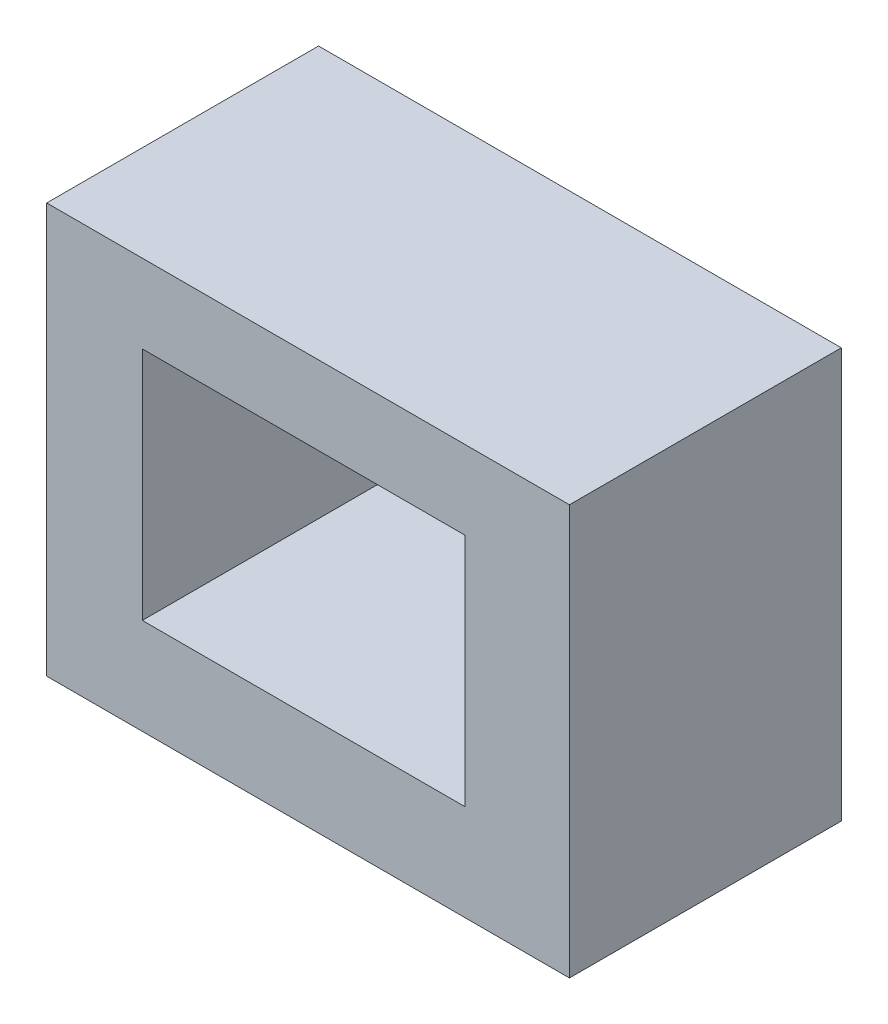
ISO-10303-21;
HEADER;
FILE_DESCRIPTION(('STEP AP214'),'2;1');
FILE_NAME('part.step','',(''),(''),'','','');
FILE_SCHEMA(('AUTOMOTIVE_DESIGN { 1 0 10303 214 1 1 1 1 }'));
ENDSEC;
DATA;
#1=APPLICATION_CONTEXT('core data for automotive mechanical design processes');
#2=APPLICATION_PROTOCOL_DEFINITION('international standard','automotive_design',2000,#1);
#3=PRODUCT_CONTEXT('',#1,'mechanical');
#4=PRODUCT('Part','Part','',(#3));
#5=PRODUCT_RELATED_PRODUCT_CATEGORY('part','',(#4));
#6=PRODUCT_DEFINITION_FORMATION('','',#4);
#7=PRODUCT_DEFINITION_CONTEXT('part definition',#1,'design');
#8=PRODUCT_DEFINITION('design','',#6,#7);
#9=PRODUCT_DEFINITION_SHAPE('','',#8);
#10=(LENGTH_UNIT() NAMED_UNIT(*) SI_UNIT(.MILLI.,.METRE.));
#11=(NAMED_UNIT(*) PLANE_ANGLE_UNIT() SI_UNIT($,.RADIAN.));
#12=(NAMED_UNIT(*) SI_UNIT($,.STERADIAN.) SOLID_ANGLE_UNIT());
#13=UNCERTAINTY_MEASURE_WITH_UNIT(LENGTH_MEASURE(1.E-05),#10,'distance_accuracy_value','');
#14=(GEOMETRIC_REPRESENTATION_CONTEXT(3) GLOBAL_UNCERTAINTY_ASSIGNED_CONTEXT((#13)) GLOBAL_UNIT_ASSIGNED_CONTEXT((#10,
#11,#12)) REPRESENTATION_CONTEXT('',''));
#15=CARTESIAN_POINT('',(0.,0.,0.));
#16=DIRECTION('',(0.,0.,1.));
#17=DIRECTION('',(1.,0.,0.));
#18=AXIS2_PLACEMENT_3D('',#15,#16,#17);
#19=CARTESIAN_POINT('',(-40.3021650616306,32.3007964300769,50.8));
#20=DIRECTION('',(1.,0.,0.));
#21=DIRECTION('',(0.,0.,-1.));
#22=AXIS2_PLACEMENT_3D('',#19,#20,#21);
#23=PLANE('',#22);
#24=DIRECTION('',(0.,-1.,0.));
#25=VECTOR('',#24,1.);
#26=CARTESIAN_POINT('',(-40.3021650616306,32.3007964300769,0.));
#27=LINE('',#26,#25);
#28=CARTESIAN_POINT('',(-40.3021650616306,32.3007964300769,0.));
#29=VERTEX_POINT('',#28);
#30=CARTESIAN_POINT('',(-40.3021650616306,-44.2826803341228,0.));
#31=VERTEX_POINT('',#30);
#32=EDGE_CURVE('E129',#29,#31,#27,.T.);
#33=ORIENTED_EDGE('',*,*,#32,.T.);
#34=DIRECTION('',(0.,0.,-1.));
#35=VECTOR('',#34,1.);
#36=CARTESIAN_POINT('',(-40.3021650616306,-44.2826803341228,50.8));
#37=LINE('',#36,#35);
#38=CARTESIAN_POINT('',(-40.3021650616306,-44.2826803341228,50.8));
#39=VERTEX_POINT('',#38);
#40=EDGE_CURVE('E11',#39,#31,#37,.T.);
#41=ORIENTED_EDGE('',*,*,#40,.F.);
#42=DIRECTION('',(0.,-1.,0.));
#43=VECTOR('',#42,1.);
#44=CARTESIAN_POINT('',(-40.3021650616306,32.3007964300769,50.8));
#45=LINE('',#44,#43);
#46=CARTESIAN_POINT('',(-40.3021650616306,32.3007964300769,50.8));
#47=VERTEX_POINT('',#46);
#48=EDGE_CURVE('E140',#47,#39,#45,.T.);
#49=ORIENTED_EDGE('',*,*,#48,.F.);
#50=DIRECTION('',(0.,0.,-1.));
#51=VECTOR('',#50,1.);
#52=CARTESIAN_POINT('',(-40.3021650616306,32.3007964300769,50.8));
#53=LINE('',#52,#51);
#54=EDGE_CURVE('E149',#47,#29,#53,.T.);
#55=ORIENTED_EDGE('',*,*,#54,.T.);
#56=EDGE_LOOP('',(#33,#41,#49,#55));
#57=FACE_BOUND('',#56,.T.);
#58=ADVANCED_FACE('F31',(#57),#23,.F.);
#59=CARTESIAN_POINT('',(-40.3021650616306,-44.2826803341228,50.8));
#60=DIRECTION('',(0.,1.,0.));
#61=DIRECTION('',(0.,0.,1.));
#62=AXIS2_PLACEMENT_3D('',#59,#60,#61);
#63=PLANE('',#62);
#64=DIRECTION('',(1.,0.,0.));
#65=VECTOR('',#64,1.);
#66=CARTESIAN_POINT('',(-40.3021650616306,-44.2826803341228,0.));
#67=LINE('',#66,#65);
#68=CARTESIAN_POINT('',(57.384314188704,-44.2826803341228,0.));
#69=VERTEX_POINT('',#68);
#70=EDGE_CURVE('E134',#31,#69,#67,.T.);
#71=ORIENTED_EDGE('',*,*,#70,.T.);
#72=DIRECTION('',(0.,0.,-1.));
#73=VECTOR('',#72,1.);
#74=CARTESIAN_POINT('',(57.384314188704,-44.2826803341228,50.8));
#75=LINE('',#74,#73);
#76=CARTESIAN_POINT('',(57.384314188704,-44.2826803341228,50.8));
#77=VERTEX_POINT('',#76);
#78=EDGE_CURVE('E38',#77,#69,#75,.T.);
#79=ORIENTED_EDGE('',*,*,#78,.F.);
#80=DIRECTION('',(1.,0.,0.));
#81=VECTOR('',#80,1.);
#82=CARTESIAN_POINT('',(-40.3021650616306,-44.2826803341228,50.8));
#83=LINE('',#82,#81);
#84=EDGE_CURVE('E143',#39,#77,#83,.T.);
#85=ORIENTED_EDGE('',*,*,#84,.F.);
#86=ORIENTED_EDGE('',*,*,#40,.T.);
#87=EDGE_LOOP('',(#71,#79,#85,#86));
#88=FACE_BOUND('',#87,.T.);
#89=ADVANCED_FACE('F173',(#88),#63,.F.);
#90=CARTESIAN_POINT('',(57.384314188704,32.3007964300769,50.8));
#91=DIRECTION('',(-1.,0.,0.));
#92=DIRECTION('',(0.,0.,1.));
#93=AXIS2_PLACEMENT_3D('',#90,#91,#92);
#94=PLANE('',#93);
#95=DIRECTION('',(0.,1.,0.));
#96=VECTOR('',#95,1.);
#97=CARTESIAN_POINT('',(57.384314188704,32.3007964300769,0.));
#98=LINE('',#97,#96);
#99=CARTESIAN_POINT('',(57.384314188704,32.3007964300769,0.));
#100=VERTEX_POINT('',#99);
#101=EDGE_CURVE('E136',#69,#100,#98,.T.);
#102=ORIENTED_EDGE('',*,*,#101,.T.);
#103=DIRECTION('',(0.,0.,-1.));
#104=VECTOR('',#103,1.);
#105=CARTESIAN_POINT('',(57.384314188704,32.3007964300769,50.8));
#106=LINE('',#105,#104);
#107=CARTESIAN_POINT('',(57.384314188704,32.3007964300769,50.8));
#108=VERTEX_POINT('',#107);
#109=EDGE_CURVE('E152',#108,#100,#106,.T.);
#110=ORIENTED_EDGE('',*,*,#109,.F.);
#111=DIRECTION('',(0.,1.,0.));
#112=VECTOR('',#111,1.);
#113=CARTESIAN_POINT('',(57.384314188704,32.3007964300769,50.8));
#114=LINE('',#113,#112);
#115=EDGE_CURVE('E145',#77,#108,#114,.T.);
#116=ORIENTED_EDGE('',*,*,#115,.F.);
#117=ORIENTED_EDGE('',*,*,#78,.T.);
#118=EDGE_LOOP('',(#102,#110,#116,#117));
#119=FACE_BOUND('',#118,.T.);
#120=ADVANCED_FACE('F159',(#119),#94,.F.);
#121=CARTESIAN_POINT('',(-40.3021650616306,32.3007964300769,50.8));
#122=DIRECTION('',(0.,-1.,0.));
#123=DIRECTION('',(0.,0.,-1.));
#124=AXIS2_PLACEMENT_3D('',#121,#122,#123);
#125=PLANE('',#124);
#126=DIRECTION('',(-1.,0.,0.));
#127=VECTOR('',#126,1.);
#128=CARTESIAN_POINT('',(-40.3021650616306,32.3007964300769,0.));
#129=LINE('',#128,#127);
#130=EDGE_CURVE('E138',#100,#29,#129,.T.);
#131=ORIENTED_EDGE('',*,*,#130,.T.);
#132=ORIENTED_EDGE('',*,*,#54,.F.);
#133=DIRECTION('',(-1.,0.,0.));
#134=VECTOR('',#133,1.);
#135=CARTESIAN_POINT('',(-40.3021650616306,32.3007964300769,50.8));
#136=LINE('',#135,#134);
#137=EDGE_CURVE('E147',#108,#47,#136,.T.);
#138=ORIENTED_EDGE('',*,*,#137,.F.);
#139=ORIENTED_EDGE('',*,*,#109,.T.);
#140=EDGE_LOOP('',(#131,#132,#138,#139));
#141=FACE_BOUND('',#140,.T.);
#142=ADVANCED_FACE('F168',(#141),#125,.F.);
#143=CARTESIAN_POINT('',(-40.3021650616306,-44.2826803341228,50.8));
#144=DIRECTION('',(0.,0.,1.));
#145=DIRECTION('',(1.,0.,0.));
#146=AXIS2_PLACEMENT_3D('',#143,#144,#145);
#147=PLANE('',#146);
#148=DIRECTION('',(0.,-1.,0.));
#149=VECTOR('',#148,1.);
#150=CARTESIAN_POINT('',(-22.4365812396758,17.6175798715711,50.8));
#151=LINE('',#150,#149);
#152=CARTESIAN_POINT('',(-22.4365812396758,17.6175798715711,50.8));
#153=VERTEX_POINT('',#152);
#154=CARTESIAN_POINT('',(-22.4365812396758,-26.3242931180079,50.8));
#155=VERTEX_POINT('',#154);
#156=EDGE_CURVE('E45',#153,#155,#151,.T.);
#157=ORIENTED_EDGE('',*,*,#156,.F.);
#158=DIRECTION('',(-1.,0.,0.));
#159=VECTOR('',#158,1.);
#160=CARTESIAN_POINT('',(-22.4365812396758,17.6175798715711,50.8));
#161=LINE('',#160,#159);
#162=CARTESIAN_POINT('',(37.8811450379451,17.6175798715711,50.8));
#163=VERTEX_POINT('',#162);
#164=EDGE_CURVE('E113',#163,#153,#161,.T.);
#165=ORIENTED_EDGE('',*,*,#164,.F.);
#166=DIRECTION('',(0.,1.,0.));
#167=VECTOR('',#166,1.);
#168=CARTESIAN_POINT('',(37.8811450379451,17.6175798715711,50.8));
#169=LINE('',#168,#167);
#170=CARTESIAN_POINT('',(37.8811450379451,-26.3242931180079,50.8));
#171=VERTEX_POINT('',#170);
#172=EDGE_CURVE('E97',#171,#163,#169,.T.);
#173=ORIENTED_EDGE('',*,*,#172,.F.);
#174=DIRECTION('',(1.,0.,0.));
#175=VECTOR('',#174,1.);
#176=CARTESIAN_POINT('',(-22.4365812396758,-26.3242931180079,50.8));
#177=LINE('',#176,#175);
#178=EDGE_CURVE('E106',#155,#171,#177,.T.);
#179=ORIENTED_EDGE('',*,*,#178,.F.);
#180=EDGE_LOOP('',(#157,#165,#173,#179));
#181=FACE_BOUND('',#180,.T.);
#182=ORIENTED_EDGE('',*,*,#48,.T.);
#183=ORIENTED_EDGE('',*,*,#84,.T.);
#184=ORIENTED_EDGE('',*,*,#115,.T.);
#185=ORIENTED_EDGE('',*,*,#137,.T.);
#186=EDGE_LOOP('',(#182,#183,#184,#185));
#187=FACE_BOUND('',#186,.T.);
#188=ADVANCED_FACE('F110',(#181,#187),#147,.T.);
#189=CARTESIAN_POINT('',(-40.3021650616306,-44.2826803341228,0.));
#190=DIRECTION('',(0.,0.,1.));
#191=DIRECTION('',(1.,0.,0.));
#192=AXIS2_PLACEMENT_3D('',#189,#190,#191);
#193=PLANE('',#192);
#194=DIRECTION('',(-1.,0.,0.));
#195=VECTOR('',#194,1.);
#196=CARTESIAN_POINT('',(-22.4365812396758,17.6175798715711,0.));
#197=LINE('',#196,#195);
#198=CARTESIAN_POINT('',(37.8811450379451,17.6175798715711,0.));
#199=VERTEX_POINT('',#198);
#200=CARTESIAN_POINT('',(-22.4365812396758,17.6175798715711,0.));
#201=VERTEX_POINT('',#200);
#202=EDGE_CURVE('E124',#199,#201,#197,.T.);
#203=ORIENTED_EDGE('',*,*,#202,.T.);
#204=DIRECTION('',(0.,-1.,0.));
#205=VECTOR('',#204,1.);
#206=CARTESIAN_POINT('',(-22.4365812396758,17.6175798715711,0.));
#207=LINE('',#206,#205);
#208=CARTESIAN_POINT('',(-22.4365812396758,-26.3242931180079,0.));
#209=VERTEX_POINT('',#208);
#210=EDGE_CURVE('E115',#201,#209,#207,.T.);
#211=ORIENTED_EDGE('',*,*,#210,.T.);
#212=DIRECTION('',(1.,0.,0.));
#213=VECTOR('',#212,1.);
#214=CARTESIAN_POINT('',(-22.4365812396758,-26.3242931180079,0.));
#215=LINE('',#214,#213);
#216=CARTESIAN_POINT('',(37.8811450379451,-26.3242931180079,0.));
#217=VERTEX_POINT('',#216);
#218=EDGE_CURVE('E121',#209,#217,#215,.T.);
#219=ORIENTED_EDGE('',*,*,#218,.T.);
#220=DIRECTION('',(0.,1.,0.));
#221=VECTOR('',#220,1.);
#222=CARTESIAN_POINT('',(37.8811450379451,17.6175798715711,0.));
#223=LINE('',#222,#221);
#224=EDGE_CURVE('E53',#217,#199,#223,.T.);
#225=ORIENTED_EDGE('',*,*,#224,.T.);
#226=EDGE_LOOP('',(#203,#211,#219,#225));
#227=FACE_BOUND('',#226,.T.);
#228=ORIENTED_EDGE('',*,*,#32,.F.);
#229=ORIENTED_EDGE('',*,*,#130,.F.);
#230=ORIENTED_EDGE('',*,*,#101,.F.);
#231=ORIENTED_EDGE('',*,*,#70,.F.);
#232=EDGE_LOOP('',(#228,#229,#230,#231));
#233=FACE_BOUND('',#232,.T.);
#234=ADVANCED_FACE('F165',(#227,#233),#193,.F.);
#235=CARTESIAN_POINT('',(-22.4365812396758,17.6175798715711,0.));
#236=DIRECTION('',(-1.,0.,0.));
#237=DIRECTION('',(0.,0.,1.));
#238=AXIS2_PLACEMENT_3D('',#235,#236,#237);
#239=PLANE('',#238);
#240=ORIENTED_EDGE('',*,*,#156,.T.);
#241=DIRECTION('',(0.,0.,1.));
#242=VECTOR('',#241,1.);
#243=CARTESIAN_POINT('',(-22.4365812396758,-26.3242931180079,0.));
#244=LINE('',#243,#242);
#245=EDGE_CURVE('E103',#209,#155,#244,.T.);
#246=ORIENTED_EDGE('',*,*,#245,.F.);
#247=ORIENTED_EDGE('',*,*,#210,.F.);
#248=DIRECTION('',(0.,0.,1.));
#249=VECTOR('',#248,1.);
#250=CARTESIAN_POINT('',(-22.4365812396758,17.6175798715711,0.));
#251=LINE('',#250,#249);
#252=EDGE_CURVE('E127',#201,#153,#251,.T.);
#253=ORIENTED_EDGE('',*,*,#252,.T.);
#254=EDGE_LOOP('',(#240,#246,#247,#253));
#255=FACE_BOUND('',#254,.T.);
#256=ADVANCED_FACE('F187',(#255),#239,.F.);
#257=CARTESIAN_POINT('',(-22.4365812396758,17.6175798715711,0.));
#258=DIRECTION('',(0.,1.,0.));
#259=DIRECTION('',(0.,0.,1.));
#260=AXIS2_PLACEMENT_3D('',#257,#258,#259);
#261=PLANE('',#260);
#262=ORIENTED_EDGE('',*,*,#164,.T.);
#263=ORIENTED_EDGE('',*,*,#252,.F.);
#264=ORIENTED_EDGE('',*,*,#202,.F.);
#265=DIRECTION('',(0.,0.,1.));
#266=VECTOR('',#265,1.);
#267=CARTESIAN_POINT('',(37.8811450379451,17.6175798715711,0.));
#268=LINE('',#267,#266);
#269=EDGE_CURVE('E102',#199,#163,#268,.T.);
#270=ORIENTED_EDGE('',*,*,#269,.T.);
#271=EDGE_LOOP('',(#262,#263,#264,#270));
#272=FACE_BOUND('',#271,.T.);
#273=ADVANCED_FACE('F191',(#272),#261,.F.);
#274=CARTESIAN_POINT('',(37.8811450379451,17.6175798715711,0.));
#275=DIRECTION('',(1.,0.,0.));
#276=DIRECTION('',(0.,0.,-1.));
#277=AXIS2_PLACEMENT_3D('',#274,#275,#276);
#278=PLANE('',#277);
#279=ORIENTED_EDGE('',*,*,#172,.T.);
#280=ORIENTED_EDGE('',*,*,#269,.F.);
#281=ORIENTED_EDGE('',*,*,#224,.F.);
#282=DIRECTION('',(0.,0.,1.));
#283=VECTOR('',#282,1.);
#284=CARTESIAN_POINT('',(37.8811450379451,-26.3242931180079,0.));
#285=LINE('',#284,#283);
#286=EDGE_CURVE('E93',#217,#171,#285,.T.);
#287=ORIENTED_EDGE('',*,*,#286,.T.);
#288=EDGE_LOOP('',(#279,#280,#281,#287));
#289=FACE_BOUND('',#288,.T.);
#290=ADVANCED_FACE('F95',(#289),#278,.F.);
#291=CARTESIAN_POINT('',(-22.4365812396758,-26.3242931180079,0.));
#292=DIRECTION('',(0.,-1.,0.));
#293=DIRECTION('',(0.,0.,-1.));
#294=AXIS2_PLACEMENT_3D('',#291,#292,#293);
#295=PLANE('',#294);
#296=ORIENTED_EDGE('',*,*,#178,.T.);
#297=ORIENTED_EDGE('',*,*,#286,.F.);
#298=ORIENTED_EDGE('',*,*,#218,.F.);
#299=ORIENTED_EDGE('',*,*,#245,.T.);
#300=EDGE_LOOP('',(#296,#297,#298,#299));
#301=FACE_BOUND('',#300,.T.);
#302=ADVANCED_FACE('F107',(#301),#295,.F.);
#303=CLOSED_SHELL('',(#58,#89,#120,#142,#188,#234,#256,#273,#290,#302));
#304=MANIFOLD_SOLID_BREP('B2',#303);
#305=ADVANCED_BREP_SHAPE_REPRESENTATION('',(#18,#304),#14);
#306=SHAPE_DEFINITION_REPRESENTATION(#9,#305);
ENDSEC;
END-ISO-10303-21;
